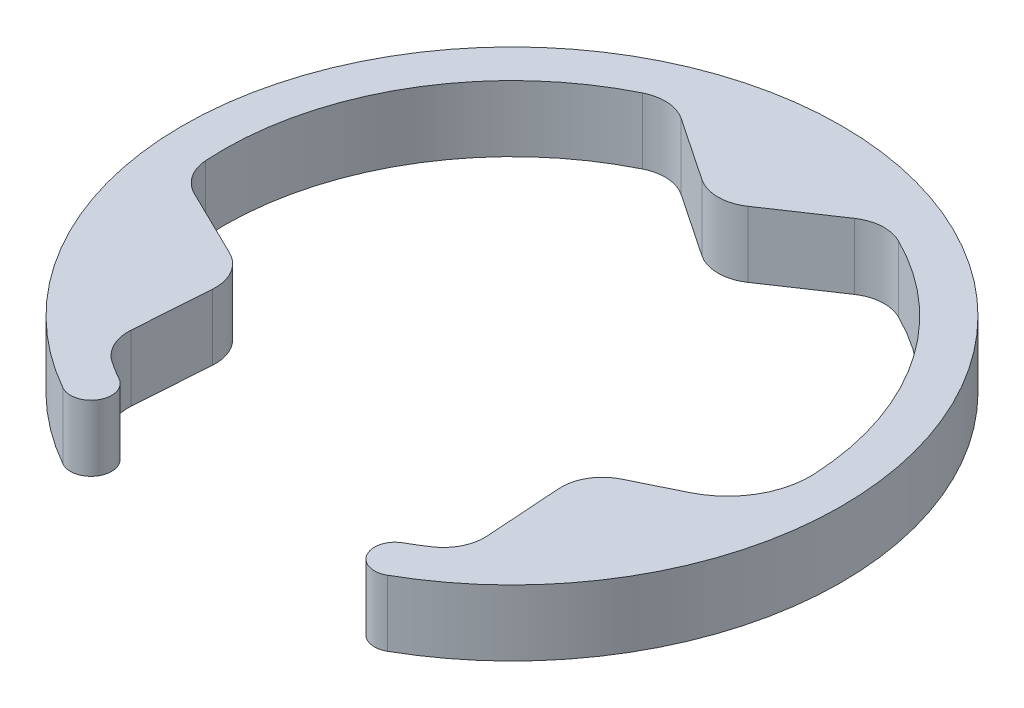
from build123d import *

# Parameters (mm, degrees)
BOSS_EXTRU_1_DEPTH = 0.8


with BuildPart() as part:
    # Esquisse1 → Boss.-Extru.1 (new body)
    with BuildSketch(Plane(origin=(0, 0.8, 0), x_dir=(1, 0, 0), z_dir=(0, 1, 0))):
        with BuildLine():
            Line((-2.162781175, -2.462096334), (-2.099244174, -1.534155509))
            ThreePointArc((-2.099244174, -1.534155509), (-2.165063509, -1.25), (-2.378239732, -1.050921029))
            Line((-2.378239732, -1.050921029), (-3.21362856, -0.641975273))
            ThreePointArc((-3.21362856, -0.641975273), (-3.409275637, -0.471057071), (-3.492757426, -0.225045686))
            ThreePointArc((-3.492757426, -0.225045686), (-3.031088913, 1.75), (-1.551483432, 3.137339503))
            ThreePointArc((-1.551483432, 3.137339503), (-1.296690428, 3.188047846), (-1.050847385, 3.104071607))
            Line((-1.050847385, 3.104071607), (-0.278995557, 2.585076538))
            ThreePointArc((-0.278995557, 2.585076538), (0, 2.5), (0.278995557, 2.585076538))
            Line((0.278995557, 2.585076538), (1.050847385, 3.104071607))
            ThreePointArc((1.050847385, 3.104071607), (1.296690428, 3.188047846), (1.551483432, 3.137339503))
            ThreePointArc((1.551483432, 3.137339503), (2.927793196, 1.917818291), (3.495921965, 0.168907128))
            ThreePointArc((3.495921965, 0.168907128), (3.358047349, -0.388024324), (2.936760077, -0.777509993))
            Line((2.936760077, -0.777509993), (2.378239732, -1.050921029))
            ThreePointArc((2.378239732, -1.050921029), (2.165063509, -1.25), (2.099244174, -1.534155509))
            Line((2.099244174, -1.534155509), (2.162781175, -2.462096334))
            ThreePointArc((2.162781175, -2.462096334), (2.112585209, -2.716990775), (1.941273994, -2.912293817))
            ThreePointArc((1.941273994, -2.912293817), (1.833055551, -2.981594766), (1.72236602, -3.046876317))
            ThreePointArc((1.72236602, -3.046876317), (1.627758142, -3.387536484), (1.968418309, -3.482144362))
            ThreePointArc((1.968418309, -3.482144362), (0, 4), (-1.968418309, -3.482144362))
            ThreePointArc((-1.968418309, -3.482144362), (-1.627758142, -3.387536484), (-1.72236602, -3.046876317))
            ThreePointArc((-1.72236602, -3.046876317), (-1.833055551, -2.981594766), (-1.941273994, -2.912293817))
            ThreePointArc((-1.941273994, -2.912293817), (-2.112585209, -2.716990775), (-2.162781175, -2.462096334))
        make_face()
    extrude(amount=-BOSS_EXTRU_1_DEPTH)


solid = part.part
